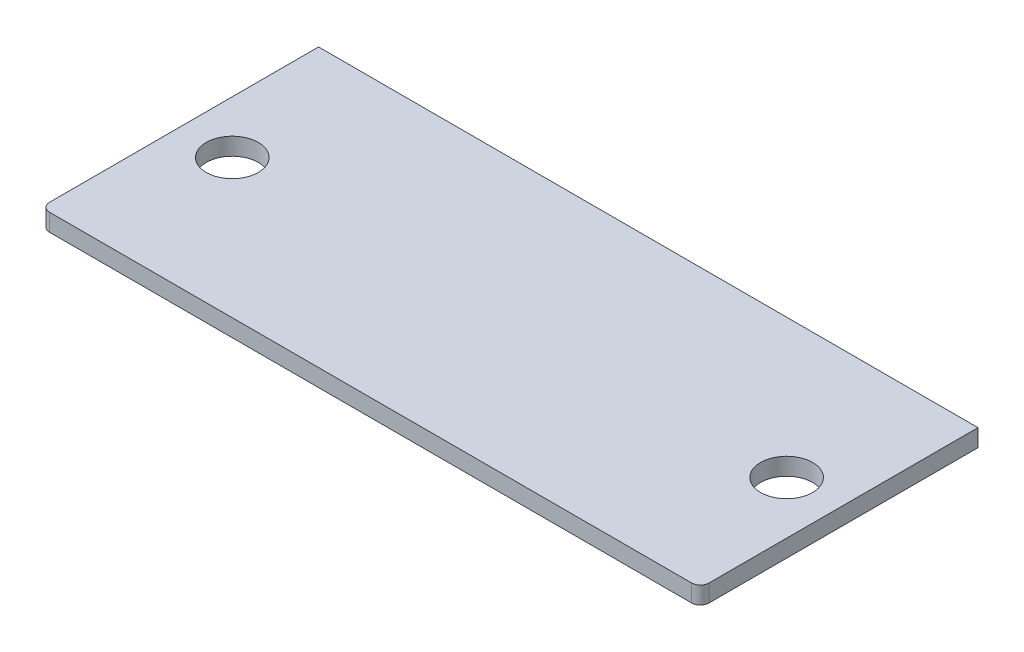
ISO-10303-21;
HEADER;
FILE_DESCRIPTION(('STEP AP214'),'2;1');
FILE_NAME('part.step','',(''),(''),'','','');
FILE_SCHEMA(('AUTOMOTIVE_DESIGN { 1 0 10303 214 1 1 1 1 }'));
ENDSEC;
DATA;
#1=APPLICATION_CONTEXT('core data for automotive mechanical design processes');
#2=APPLICATION_PROTOCOL_DEFINITION('international standard','automotive_design',2000,#1);
#3=PRODUCT_CONTEXT('',#1,'mechanical');
#4=PRODUCT('Part','Part','',(#3));
#5=PRODUCT_RELATED_PRODUCT_CATEGORY('part','',(#4));
#6=PRODUCT_DEFINITION_FORMATION('','',#4);
#7=PRODUCT_DEFINITION_CONTEXT('part definition',#1,'design');
#8=PRODUCT_DEFINITION('design','',#6,#7);
#9=PRODUCT_DEFINITION_SHAPE('','',#8);
#10=(LENGTH_UNIT() NAMED_UNIT(*) SI_UNIT(.MILLI.,.METRE.));
#11=(NAMED_UNIT(*) PLANE_ANGLE_UNIT() SI_UNIT($,.RADIAN.));
#12=(NAMED_UNIT(*) SI_UNIT($,.STERADIAN.) SOLID_ANGLE_UNIT());
#13=UNCERTAINTY_MEASURE_WITH_UNIT(LENGTH_MEASURE(1.E-05),#10,'distance_accuracy_value','');
#14=(GEOMETRIC_REPRESENTATION_CONTEXT(3) GLOBAL_UNCERTAINTY_ASSIGNED_CONTEXT((#13)) GLOBAL_UNIT_ASSIGNED_CONTEXT((#10,
#11,#12)) REPRESENTATION_CONTEXT('',''));
#15=CARTESIAN_POINT('',(0.,0.,0.));
#16=DIRECTION('',(0.,0.,1.));
#17=DIRECTION('',(1.,0.,0.));
#18=AXIS2_PLACEMENT_3D('',#15,#16,#17);
#19=CARTESIAN_POINT('',(0.,1.,-16.));
#20=DIRECTION('',(0.,-1.,0.));
#21=DIRECTION('',(0.,0.,-1.));
#22=AXIS2_PLACEMENT_3D('',#19,#20,#21);
#23=PLANE('',#22);
#24=CARTESIAN_POINT('',(34.9715657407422,1.,-8.));
#25=DIRECTION('',(0.,1.,0.));
#26=DIRECTION('',(0.,0.,1.));
#27=AXIS2_PLACEMENT_3D('',#24,#25,#26);
#28=CIRCLE('',#27,1.5);
#29=CARTESIAN_POINT('',(34.9715657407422,1.,-6.5));
#30=VERTEX_POINT('',#29);
#31=EDGE_CURVE('E137',#30,#30,#28,.T.);
#32=ORIENTED_EDGE('',*,*,#31,.F.);
#33=EDGE_LOOP('',(#32));
#34=FACE_BOUND('',#33,.T.);
#35=DIRECTION('',(0.,0.,1.));
#36=VECTOR('',#35,1.);
#37=CARTESIAN_POINT('',(0.,1.,0.));
#38=LINE('',#37,#36);
#39=CARTESIAN_POINT('',(0.,1.,-16.));
#40=VERTEX_POINT('',#39);
#41=CARTESIAN_POINT('',(0.,1.,-0.5));
#42=VERTEX_POINT('',#41);
#43=EDGE_CURVE('E107',#40,#42,#38,.T.);
#44=ORIENTED_EDGE('',*,*,#43,.T.);
#45=CARTESIAN_POINT('',(0.5,1.,-0.5));
#46=DIRECTION('',(0.,-1.,0.));
#47=DIRECTION('',(0.,0.,-1.));
#48=AXIS2_PLACEMENT_3D('',#45,#46,#47);
#49=CIRCLE('',#48,0.5);
#50=CARTESIAN_POINT('',(0.5,1.,0.));
#51=VERTEX_POINT('',#50);
#52=EDGE_CURVE('E35',#42,#51,#49,.F.);
#53=ORIENTED_EDGE('',*,*,#52,.T.);
#54=DIRECTION('',(1.,0.,0.));
#55=VECTOR('',#54,1.);
#56=CARTESIAN_POINT('',(0.,1.,0.));
#57=LINE('',#56,#55);
#58=CARTESIAN_POINT('',(37.5,1.,0.));
#59=VERTEX_POINT('',#58);
#60=EDGE_CURVE('E109',#51,#59,#57,.T.);
#61=ORIENTED_EDGE('',*,*,#60,.T.);
#62=CARTESIAN_POINT('',(37.5,1.,-0.5));
#63=DIRECTION('',(0.,-1.,0.));
#64=DIRECTION('',(0.,0.,-1.));
#65=AXIS2_PLACEMENT_3D('',#62,#63,#64);
#66=CIRCLE('',#65,0.5);
#67=CARTESIAN_POINT('',(38.,1.,-0.5));
#68=VERTEX_POINT('',#67);
#69=EDGE_CURVE('E42',#59,#68,#66,.F.);
#70=ORIENTED_EDGE('',*,*,#69,.T.);
#71=DIRECTION('',(0.,0.,-1.));
#72=VECTOR('',#71,1.);
#73=CARTESIAN_POINT('',(38.,1.,0.));
#74=LINE('',#73,#72);
#75=CARTESIAN_POINT('',(38.,1.,-16.));
#76=VERTEX_POINT('',#75);
#77=EDGE_CURVE('E114',#68,#76,#74,.T.);
#78=ORIENTED_EDGE('',*,*,#77,.T.);
#79=DIRECTION('',(-1.,0.,0.));
#80=VECTOR('',#79,1.);
#81=CARTESIAN_POINT('',(0.,1.,-16.));
#82=LINE('',#81,#80);
#83=EDGE_CURVE('E98',#76,#40,#82,.T.);
#84=ORIENTED_EDGE('',*,*,#83,.T.);
#85=EDGE_LOOP('',(#44,#53,#61,#70,#78,#84));
#86=FACE_BOUND('',#85,.T.);
#87=CARTESIAN_POINT('',(3.02843425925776,1.,-8.));
#88=DIRECTION('',(0.,1.,0.));
#89=DIRECTION('',(0.,0.,-1.));
#90=AXIS2_PLACEMENT_3D('',#87,#88,#89);
#91=CIRCLE('',#90,1.5);
#92=CARTESIAN_POINT('',(3.02843425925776,1.,-9.50000000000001));
#93=VERTEX_POINT('',#92);
#94=EDGE_CURVE('E145',#93,#93,#91,.T.);
#95=ORIENTED_EDGE('',*,*,#94,.F.);
#96=EDGE_LOOP('',(#95));
#97=FACE_BOUND('',#96,.T.);
#98=ADVANCED_FACE('F27',(#34,#86,#97),#23,.F.);
#99=CARTESIAN_POINT('',(0.,0.,-16.));
#100=DIRECTION('',(0.,-1.,0.));
#101=DIRECTION('',(0.,0.,-1.));
#102=AXIS2_PLACEMENT_3D('',#99,#100,#101);
#103=PLANE('',#102);
#104=CARTESIAN_POINT('',(34.9715657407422,0.,-8.));
#105=DIRECTION('',(0.,1.,0.));
#106=DIRECTION('',(0.,0.,1.));
#107=AXIS2_PLACEMENT_3D('',#104,#105,#106);
#108=CIRCLE('',#107,1.5);
#109=CARTESIAN_POINT('',(34.9715657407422,0.,-6.5));
#110=VERTEX_POINT('',#109);
#111=EDGE_CURVE('E140',#110,#110,#108,.T.);
#112=ORIENTED_EDGE('',*,*,#111,.T.);
#113=EDGE_LOOP('',(#112));
#114=FACE_BOUND('',#113,.T.);
#115=DIRECTION('',(1.,0.,0.));
#116=VECTOR('',#115,1.);
#117=CARTESIAN_POINT('',(0.,0.,0.));
#118=LINE('',#117,#116);
#119=CARTESIAN_POINT('',(0.5,0.,0.));
#120=VERTEX_POINT('',#119);
#121=CARTESIAN_POINT('',(37.5,0.,0.));
#122=VERTEX_POINT('',#121);
#123=EDGE_CURVE('E92',#120,#122,#118,.T.);
#124=ORIENTED_EDGE('',*,*,#123,.F.);
#125=CARTESIAN_POINT('',(0.5,0.,-0.5));
#126=DIRECTION('',(0.,-1.,0.));
#127=DIRECTION('',(0.,0.,-1.));
#128=AXIS2_PLACEMENT_3D('',#125,#126,#127);
#129=CIRCLE('',#128,0.5);
#130=CARTESIAN_POINT('',(0.,0.,-0.5));
#131=VERTEX_POINT('',#130);
#132=EDGE_CURVE('E124',#120,#131,#129,.T.);
#133=ORIENTED_EDGE('',*,*,#132,.T.);
#134=DIRECTION('',(0.,0.,1.));
#135=VECTOR('',#134,1.);
#136=CARTESIAN_POINT('',(0.,0.,0.));
#137=LINE('',#136,#135);
#138=CARTESIAN_POINT('',(0.,0.,-16.));
#139=VERTEX_POINT('',#138);
#140=EDGE_CURVE('E106',#139,#131,#137,.T.);
#141=ORIENTED_EDGE('',*,*,#140,.F.);
#142=DIRECTION('',(-1.,0.,0.));
#143=VECTOR('',#142,1.);
#144=CARTESIAN_POINT('',(0.,0.,-16.));
#145=LINE('',#144,#143);
#146=CARTESIAN_POINT('',(38.,0.,-16.));
#147=VERTEX_POINT('',#146);
#148=EDGE_CURVE('E91',#147,#139,#145,.T.);
#149=ORIENTED_EDGE('',*,*,#148,.F.);
#150=DIRECTION('',(0.,0.,-1.));
#151=VECTOR('',#150,1.);
#152=CARTESIAN_POINT('',(38.,0.,0.));
#153=LINE('',#152,#151);
#154=CARTESIAN_POINT('',(38.,0.,-0.5));
#155=VERTEX_POINT('',#154);
#156=EDGE_CURVE('E83',#155,#147,#153,.T.);
#157=ORIENTED_EDGE('',*,*,#156,.F.);
#158=CARTESIAN_POINT('',(37.5,0.,-0.5));
#159=DIRECTION('',(0.,-1.,0.));
#160=DIRECTION('',(0.,0.,-1.));
#161=AXIS2_PLACEMENT_3D('',#158,#159,#160);
#162=CIRCLE('',#161,0.5);
#163=EDGE_CURVE('E122',#155,#122,#162,.T.);
#164=ORIENTED_EDGE('',*,*,#163,.T.);
#165=EDGE_LOOP('',(#124,#133,#141,#149,#157,#164));
#166=FACE_BOUND('',#165,.T.);
#167=CARTESIAN_POINT('',(3.02843425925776,0.,-8.));
#168=DIRECTION('',(0.,1.,0.));
#169=DIRECTION('',(0.,0.,-1.));
#170=AXIS2_PLACEMENT_3D('',#167,#168,#169);
#171=CIRCLE('',#170,1.5);
#172=CARTESIAN_POINT('',(3.02843425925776,0.,-9.50000000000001));
#173=VERTEX_POINT('',#172);
#174=EDGE_CURVE('E148',#173,#173,#171,.T.);
#175=ORIENTED_EDGE('',*,*,#174,.T.);
#176=EDGE_LOOP('',(#175));
#177=FACE_BOUND('',#176,.T.);
#178=ADVANCED_FACE('F104',(#114,#166,#177),#103,.T.);
#179=CARTESIAN_POINT('',(0.,1.,0.));
#180=DIRECTION('',(1.,0.,0.));
#181=DIRECTION('',(0.,0.,-1.));
#182=AXIS2_PLACEMENT_3D('',#179,#180,#181);
#183=PLANE('',#182);
#184=ORIENTED_EDGE('',*,*,#140,.T.);
#185=DIRECTION('',(0.,-1.,0.));
#186=VECTOR('',#185,1.);
#187=CARTESIAN_POINT('',(0.,1.,-0.5));
#188=LINE('',#187,#186);
#189=EDGE_CURVE('E50',#131,#42,#188,.F.);
#190=ORIENTED_EDGE('',*,*,#189,.T.);
#191=ORIENTED_EDGE('',*,*,#43,.F.);
#192=DIRECTION('',(0.,-1.,0.));
#193=VECTOR('',#192,1.);
#194=CARTESIAN_POINT('',(0.,1.,-16.));
#195=LINE('',#194,#193);
#196=EDGE_CURVE('E100',#40,#139,#195,.T.);
#197=ORIENTED_EDGE('',*,*,#196,.T.);
#198=EDGE_LOOP('',(#184,#190,#191,#197));
#199=FACE_BOUND('',#198,.T.);
#200=ADVANCED_FACE('F29',(#199),#183,.F.);
#201=CARTESIAN_POINT('',(0.,1.,0.));
#202=DIRECTION('',(0.,0.,-1.));
#203=DIRECTION('',(-1.,0.,0.));
#204=AXIS2_PLACEMENT_3D('',#201,#202,#203);
#205=PLANE('',#204);
#206=ORIENTED_EDGE('',*,*,#60,.F.);
#207=DIRECTION('',(0.,-1.,0.));
#208=VECTOR('',#207,1.);
#209=CARTESIAN_POINT('',(0.5,1.,0.));
#210=LINE('',#209,#208);
#211=EDGE_CURVE('E119',#51,#120,#210,.T.);
#212=ORIENTED_EDGE('',*,*,#211,.T.);
#213=ORIENTED_EDGE('',*,*,#123,.T.);
#214=DIRECTION('',(0.,-1.,0.));
#215=VECTOR('',#214,1.);
#216=CARTESIAN_POINT('',(37.5,1.,0.));
#217=LINE('',#216,#215);
#218=EDGE_CURVE('E99',#122,#59,#217,.F.);
#219=ORIENTED_EDGE('',*,*,#218,.T.);
#220=EDGE_LOOP('',(#206,#212,#213,#219));
#221=FACE_BOUND('',#220,.T.);
#222=ADVANCED_FACE('F133',(#221),#205,.F.);
#223=CARTESIAN_POINT('',(38.,1.,0.));
#224=DIRECTION('',(-1.,0.,0.));
#225=DIRECTION('',(0.,0.,1.));
#226=AXIS2_PLACEMENT_3D('',#223,#224,#225);
#227=PLANE('',#226);
#228=ORIENTED_EDGE('',*,*,#77,.F.);
#229=DIRECTION('',(0.,-1.,0.));
#230=VECTOR('',#229,1.);
#231=CARTESIAN_POINT('',(38.,1.,-0.5));
#232=LINE('',#231,#230);
#233=EDGE_CURVE('E11',#68,#155,#232,.T.);
#234=ORIENTED_EDGE('',*,*,#233,.T.);
#235=ORIENTED_EDGE('',*,*,#156,.T.);
#236=DIRECTION('',(0.,-1.,0.));
#237=VECTOR('',#236,1.);
#238=CARTESIAN_POINT('',(38.,1.,-16.));
#239=LINE('',#238,#237);
#240=EDGE_CURVE('E86',#76,#147,#239,.T.);
#241=ORIENTED_EDGE('',*,*,#240,.F.);
#242=EDGE_LOOP('',(#228,#234,#235,#241));
#243=FACE_BOUND('',#242,.T.);
#244=ADVANCED_FACE('F85',(#243),#227,.F.);
#245=CARTESIAN_POINT('',(0.,1.,-16.));
#246=DIRECTION('',(0.,0.,1.));
#247=DIRECTION('',(1.,0.,0.));
#248=AXIS2_PLACEMENT_3D('',#245,#246,#247);
#249=PLANE('',#248);
#250=ORIENTED_EDGE('',*,*,#148,.T.);
#251=ORIENTED_EDGE('',*,*,#196,.F.);
#252=ORIENTED_EDGE('',*,*,#83,.F.);
#253=ORIENTED_EDGE('',*,*,#240,.T.);
#254=EDGE_LOOP('',(#250,#251,#252,#253));
#255=FACE_BOUND('',#254,.T.);
#256=ADVANCED_FACE('F95',(#255),#249,.F.);
#257=CARTESIAN_POINT('',(34.9715657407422,1.,-8.));
#258=DIRECTION('',(0.,-1.,0.));
#259=DIRECTION('',(0.,0.,-1.));
#260=AXIS2_PLACEMENT_3D('',#257,#258,#259);
#261=CYLINDRICAL_SURFACE('',#260,1.5);
#262=ORIENTED_EDGE('',*,*,#31,.T.);
#263=EDGE_LOOP('',(#262));
#264=FACE_BOUND('',#263,.T.);
#265=ORIENTED_EDGE('',*,*,#111,.F.);
#266=EDGE_LOOP('',(#265));
#267=FACE_BOUND('',#266,.T.);
#268=ADVANCED_FACE('F154',(#264,#267),#261,.F.);
#269=CARTESIAN_POINT('',(3.02843425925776,1.,-8.));
#270=DIRECTION('',(0.,-1.,0.));
#271=DIRECTION('',(0.,0.,-1.));
#272=AXIS2_PLACEMENT_3D('',#269,#270,#271);
#273=CYLINDRICAL_SURFACE('',#272,1.5);
#274=ORIENTED_EDGE('',*,*,#94,.T.);
#275=EDGE_LOOP('',(#274));
#276=FACE_BOUND('',#275,.T.);
#277=ORIENTED_EDGE('',*,*,#174,.F.);
#278=EDGE_LOOP('',(#277));
#279=FACE_BOUND('',#278,.T.);
#280=ADVANCED_FACE('F152',(#276,#279),#273,.F.);
#281=CARTESIAN_POINT('',(0.5,1.,-0.5));
#282=DIRECTION('',(0.,-1.,0.));
#283=DIRECTION('',(0.,0.,-1.));
#284=AXIS2_PLACEMENT_3D('',#281,#282,#283);
#285=CYLINDRICAL_SURFACE('',#284,0.5);
#286=ORIENTED_EDGE('',*,*,#52,.F.);
#287=ORIENTED_EDGE('',*,*,#189,.F.);
#288=ORIENTED_EDGE('',*,*,#132,.F.);
#289=ORIENTED_EDGE('',*,*,#211,.F.);
#290=EDGE_LOOP('',(#286,#287,#288,#289));
#291=FACE_BOUND('',#290,.T.);
#292=ADVANCED_FACE('F136',(#291),#285,.T.);
#293=CARTESIAN_POINT('',(37.5,1.,-0.5));
#294=DIRECTION('',(0.,-1.,0.));
#295=DIRECTION('',(0.,0.,-1.));
#296=AXIS2_PLACEMENT_3D('',#293,#294,#295);
#297=CYLINDRICAL_SURFACE('',#296,0.5);
#298=ORIENTED_EDGE('',*,*,#69,.F.);
#299=ORIENTED_EDGE('',*,*,#218,.F.);
#300=ORIENTED_EDGE('',*,*,#163,.F.);
#301=ORIENTED_EDGE('',*,*,#233,.F.);
#302=EDGE_LOOP('',(#298,#299,#300,#301));
#303=FACE_BOUND('',#302,.T.);
#304=ADVANCED_FACE('F162',(#303),#297,.T.);
#305=CLOSED_SHELL('',(#98,#178,#200,#222,#244,#256,#268,#280,#292,#304));
#306=MANIFOLD_SOLID_BREP('B2',#305);
#307=ADVANCED_BREP_SHAPE_REPRESENTATION('',(#18,#306),#14);
#308=SHAPE_DEFINITION_REPRESENTATION(#9,#307);
ENDSEC;
END-ISO-10303-21;
